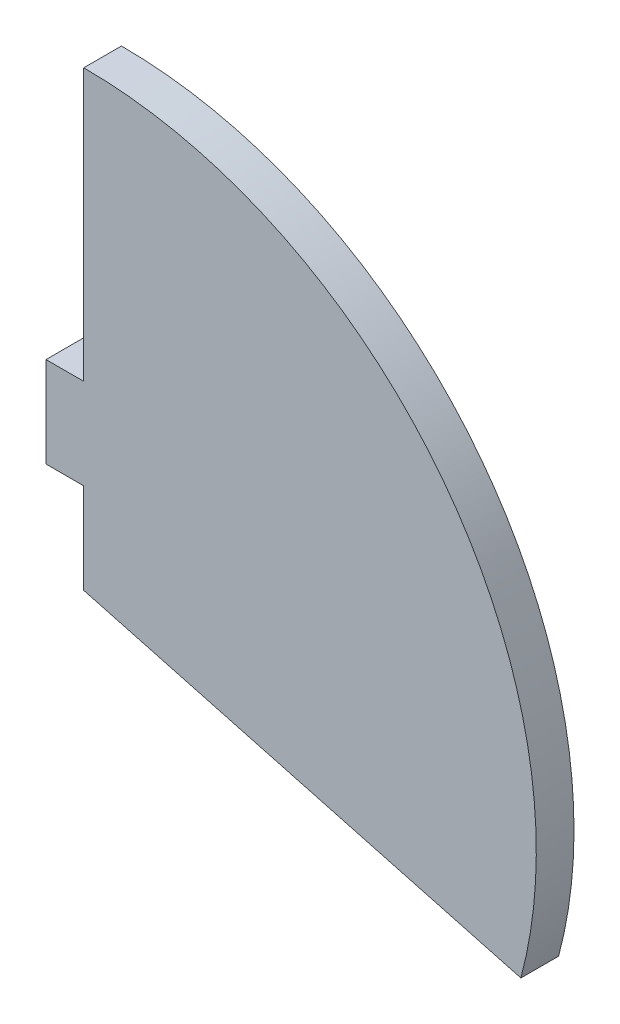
ISO-10303-21;
HEADER;
FILE_DESCRIPTION(('STEP AP214'),'2;1');
FILE_NAME('part.step','',(''),(''),'','','');
FILE_SCHEMA(('AUTOMOTIVE_DESIGN { 1 0 10303 214 1 1 1 1 }'));
ENDSEC;
DATA;
#1=APPLICATION_CONTEXT('core data for automotive mechanical design processes');
#2=APPLICATION_PROTOCOL_DEFINITION('international standard','automotive_design',2000,#1);
#3=PRODUCT_CONTEXT('',#1,'mechanical');
#4=PRODUCT('Part','Part','',(#3));
#5=PRODUCT_RELATED_PRODUCT_CATEGORY('part','',(#4));
#6=PRODUCT_DEFINITION_FORMATION('','',#4);
#7=PRODUCT_DEFINITION_CONTEXT('part definition',#1,'design');
#8=PRODUCT_DEFINITION('design','',#6,#7);
#9=PRODUCT_DEFINITION_SHAPE('','',#8);
#10=(LENGTH_UNIT() NAMED_UNIT(*) SI_UNIT(.MILLI.,.METRE.));
#11=(NAMED_UNIT(*) PLANE_ANGLE_UNIT() SI_UNIT($,.RADIAN.));
#12=(NAMED_UNIT(*) SI_UNIT($,.STERADIAN.) SOLID_ANGLE_UNIT());
#13=UNCERTAINTY_MEASURE_WITH_UNIT(LENGTH_MEASURE(1.E-05),#10,'distance_accuracy_value','');
#14=(GEOMETRIC_REPRESENTATION_CONTEXT(3) GLOBAL_UNCERTAINTY_ASSIGNED_CONTEXT((#13)) GLOBAL_UNIT_ASSIGNED_CONTEXT((#10,
#11,#12)) REPRESENTATION_CONTEXT('',''));
#15=CARTESIAN_POINT('',(0.,0.,0.));
#16=DIRECTION('',(0.,0.,1.));
#17=DIRECTION('',(1.,0.,0.));
#18=AXIS2_PLACEMENT_3D('',#15,#16,#17);
#19=CARTESIAN_POINT('',(-2.5,12.,2.5));
#20=DIRECTION('',(0.,1.,0.));
#21=DIRECTION('',(0.,0.,1.));
#22=AXIS2_PLACEMENT_3D('',#19,#20,#21);
#23=PLANE('',#22);
#24=DIRECTION('',(1.,0.,0.));
#25=VECTOR('',#24,1.);
#26=CARTESIAN_POINT('',(-2.5,12.,0.));
#27=LINE('',#26,#25);
#28=CARTESIAN_POINT('',(-2.5,12.,0.));
#29=VERTEX_POINT('',#28);
#30=CARTESIAN_POINT('',(0.,12.,0.));
#31=VERTEX_POINT('',#30);
#32=EDGE_CURVE('E123',#29,#31,#27,.T.);
#33=ORIENTED_EDGE('',*,*,#32,.F.);
#34=DIRECTION('',(0.,0.,-1.));
#35=VECTOR('',#34,1.);
#36=CARTESIAN_POINT('',(-2.5,12.,2.5));
#37=LINE('',#36,#35);
#38=CARTESIAN_POINT('',(-2.5,12.,2.5));
#39=VERTEX_POINT('',#38);
#40=EDGE_CURVE('E11',#39,#29,#37,.T.);
#41=ORIENTED_EDGE('',*,*,#40,.F.);
#42=DIRECTION('',(1.,0.,0.));
#43=VECTOR('',#42,1.);
#44=CARTESIAN_POINT('',(-2.5,12.,2.5));
#45=LINE('',#44,#43);
#46=CARTESIAN_POINT('',(0.,12.,2.5));
#47=VERTEX_POINT('',#46);
#48=EDGE_CURVE('E139',#39,#47,#45,.T.);
#49=ORIENTED_EDGE('',*,*,#48,.T.);
#50=DIRECTION('',(0.,0.,-1.));
#51=VECTOR('',#50,1.);
#52=CARTESIAN_POINT('',(0.,12.,2.5));
#53=LINE('',#52,#51);
#54=EDGE_CURVE('E36',#47,#31,#53,.T.);
#55=ORIENTED_EDGE('',*,*,#54,.T.);
#56=EDGE_LOOP('',(#33,#41,#49,#55));
#57=FACE_BOUND('',#56,.T.);
#58=ADVANCED_FACE('F33',(#57),#23,.T.);
#59=CARTESIAN_POINT('',(-2.5,6.,2.5));
#60=DIRECTION('',(-1.,0.,0.));
#61=DIRECTION('',(0.,0.,1.));
#62=AXIS2_PLACEMENT_3D('',#59,#60,#61);
#63=PLANE('',#62);
#64=DIRECTION('',(0.,1.,0.));
#65=VECTOR('',#64,1.);
#66=CARTESIAN_POINT('',(-2.5,6.,0.));
#67=LINE('',#66,#65);
#68=CARTESIAN_POINT('',(-2.5,6.,0.));
#69=VERTEX_POINT('',#68);
#70=EDGE_CURVE('E137',#69,#29,#67,.T.);
#71=ORIENTED_EDGE('',*,*,#70,.F.);
#72=DIRECTION('',(0.,0.,-1.));
#73=VECTOR('',#72,1.);
#74=CARTESIAN_POINT('',(-2.5,6.,2.5));
#75=LINE('',#74,#73);
#76=CARTESIAN_POINT('',(-2.5,6.,2.5));
#77=VERTEX_POINT('',#76);
#78=EDGE_CURVE('E42',#77,#69,#75,.T.);
#79=ORIENTED_EDGE('',*,*,#78,.F.);
#80=DIRECTION('',(0.,1.,0.));
#81=VECTOR('',#80,1.);
#82=CARTESIAN_POINT('',(-2.5,6.,2.5));
#83=LINE('',#82,#81);
#84=EDGE_CURVE('E112',#77,#39,#83,.T.);
#85=ORIENTED_EDGE('',*,*,#84,.T.);
#86=ORIENTED_EDGE('',*,*,#40,.T.);
#87=EDGE_LOOP('',(#71,#79,#85,#86));
#88=FACE_BOUND('',#87,.T.);
#89=ADVANCED_FACE('F151',(#88),#63,.T.);
#90=CARTESIAN_POINT('',(0.,6.,2.5));
#91=DIRECTION('',(0.,-1.,0.));
#92=DIRECTION('',(1.,0.,0.));
#93=AXIS2_PLACEMENT_3D('',#90,#91,#92);
#94=PLANE('',#93);
#95=DIRECTION('',(-1.,0.,0.));
#96=VECTOR('',#95,1.);
#97=CARTESIAN_POINT('',(0.,6.,0.));
#98=LINE('',#97,#96);
#99=CARTESIAN_POINT('',(0.,6.,0.));
#100=VERTEX_POINT('',#99);
#101=EDGE_CURVE('E101',#100,#69,#98,.T.);
#102=ORIENTED_EDGE('',*,*,#101,.F.);
#103=DIRECTION('',(0.,0.,-1.));
#104=VECTOR('',#103,1.);
#105=CARTESIAN_POINT('',(0.,6.,2.5));
#106=LINE('',#105,#104);
#107=CARTESIAN_POINT('',(0.,6.,2.5));
#108=VERTEX_POINT('',#107);
#109=EDGE_CURVE('E96',#108,#100,#106,.T.);
#110=ORIENTED_EDGE('',*,*,#109,.F.);
#111=DIRECTION('',(-1.,0.,0.));
#112=VECTOR('',#111,1.);
#113=CARTESIAN_POINT('',(0.,6.,2.5));
#114=LINE('',#113,#112);
#115=EDGE_CURVE('E99',#108,#77,#114,.T.);
#116=ORIENTED_EDGE('',*,*,#115,.T.);
#117=ORIENTED_EDGE('',*,*,#78,.T.);
#118=EDGE_LOOP('',(#102,#110,#116,#117));
#119=FACE_BOUND('',#118,.T.);
#120=ADVANCED_FACE('F98',(#119),#94,.T.);
#121=CARTESIAN_POINT('',(0.,0.,2.5));
#122=DIRECTION('',(-1.,0.,0.));
#123=DIRECTION('',(0.,0.,1.));
#124=AXIS2_PLACEMENT_3D('',#121,#122,#123);
#125=PLANE('',#124);
#126=DIRECTION('',(0.,1.,0.));
#127=VECTOR('',#126,1.);
#128=CARTESIAN_POINT('',(0.,0.,0.));
#129=LINE('',#128,#127);
#130=CARTESIAN_POINT('',(0.,0.,0.));
#131=VERTEX_POINT('',#130);
#132=EDGE_CURVE('E134',#131,#100,#129,.T.);
#133=ORIENTED_EDGE('',*,*,#132,.F.);
#134=DIRECTION('',(0.,0.,-1.));
#135=VECTOR('',#134,1.);
#136=CARTESIAN_POINT('',(0.,0.,2.5));
#137=LINE('',#136,#135);
#138=CARTESIAN_POINT('',(0.,0.,2.5));
#139=VERTEX_POINT('',#138);
#140=EDGE_CURVE('E106',#139,#131,#137,.T.);
#141=ORIENTED_EDGE('',*,*,#140,.F.);
#142=DIRECTION('',(0.,1.,0.));
#143=VECTOR('',#142,1.);
#144=CARTESIAN_POINT('',(0.,0.,2.5));
#145=LINE('',#144,#143);
#146=EDGE_CURVE('E111',#139,#108,#145,.T.);
#147=ORIENTED_EDGE('',*,*,#146,.T.);
#148=ORIENTED_EDGE('',*,*,#109,.T.);
#149=EDGE_LOOP('',(#133,#141,#147,#148));
#150=FACE_BOUND('',#149,.T.);
#151=ADVANCED_FACE('F114',(#150),#125,.T.);
#152=CARTESIAN_POINT('',(0.,0.,2.5));
#153=DIRECTION('',(0.258819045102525,0.965925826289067,0.));
#154=DIRECTION('',(-0.965925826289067,0.258819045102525,0.));
#155=AXIS2_PLACEMENT_3D('',#152,#153,#154);
#156=PLANE('',#155);
#157=DIRECTION('',(0.965925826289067,-0.258819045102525,0.));
#158=VECTOR('',#157,1.);
#159=CARTESIAN_POINT('',(0.,0.,0.));
#160=LINE('',#159,#158);
#161=CARTESIAN_POINT('',(28.977774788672,-7.76457135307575,0.));
#162=VERTEX_POINT('',#161);
#163=EDGE_CURVE('E132',#131,#162,#160,.T.);
#164=ORIENTED_EDGE('',*,*,#163,.T.);
#165=DIRECTION('',(0.,0.,-1.));
#166=VECTOR('',#165,1.);
#167=CARTESIAN_POINT('',(28.977774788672,-7.76457135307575,2.5));
#168=LINE('',#167,#166);
#169=CARTESIAN_POINT('',(28.977774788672,-7.76457135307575,2.5));
#170=VERTEX_POINT('',#169);
#171=EDGE_CURVE('E143',#170,#162,#168,.T.);
#172=ORIENTED_EDGE('',*,*,#171,.F.);
#173=DIRECTION('',(0.965925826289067,-0.258819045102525,0.));
#174=VECTOR('',#173,1.);
#175=CARTESIAN_POINT('',(0.,0.,2.5));
#176=LINE('',#175,#174);
#177=EDGE_CURVE('E116',#139,#170,#176,.T.);
#178=ORIENTED_EDGE('',*,*,#177,.F.);
#179=ORIENTED_EDGE('',*,*,#140,.T.);
#180=EDGE_LOOP('',(#164,#172,#178,#179));
#181=FACE_BOUND('',#180,.T.);
#182=ADVANCED_FACE('F164',(#181),#156,.F.);
#183=CARTESIAN_POINT('',(0.,0.,2.5));
#184=DIRECTION('',(0.,0.,-1.));
#185=DIRECTION('',(-1.,0.,0.));
#186=AXIS2_PLACEMENT_3D('',#183,#184,#185);
#187=CYLINDRICAL_SURFACE('',#186,30.);
#188=CARTESIAN_POINT('',(0.,0.,0.));
#189=DIRECTION('',(0.,0.,1.));
#190=DIRECTION('',(1.,0.,0.));
#191=AXIS2_PLACEMENT_3D('',#188,#189,#190);
#192=CIRCLE('',#191,30.);
#193=CARTESIAN_POINT('',(0.,30.,0.));
#194=VERTEX_POINT('',#193);
#195=EDGE_CURVE('E129',#162,#194,#192,.T.);
#196=ORIENTED_EDGE('',*,*,#195,.T.);
#197=DIRECTION('',(0.,0.,-1.));
#198=VECTOR('',#197,1.);
#199=CARTESIAN_POINT('',(0.,30.,2.5));
#200=LINE('',#199,#198);
#201=CARTESIAN_POINT('',(0.,30.,2.5));
#202=VERTEX_POINT('',#201);
#203=EDGE_CURVE('E145',#202,#194,#200,.T.);
#204=ORIENTED_EDGE('',*,*,#203,.F.);
#205=CARTESIAN_POINT('',(0.,0.,2.5));
#206=DIRECTION('',(0.,0.,1.));
#207=DIRECTION('',(1.,0.,0.));
#208=AXIS2_PLACEMENT_3D('',#205,#206,#207);
#209=CIRCLE('',#208,30.);
#210=EDGE_CURVE('E118',#170,#202,#209,.T.);
#211=ORIENTED_EDGE('',*,*,#210,.F.);
#212=ORIENTED_EDGE('',*,*,#171,.T.);
#213=EDGE_LOOP('',(#196,#204,#211,#212));
#214=FACE_BOUND('',#213,.T.);
#215=ADVANCED_FACE('F167',(#214),#187,.T.);
#216=CARTESIAN_POINT('',(0.,12.,2.5));
#217=DIRECTION('',(-1.,0.,0.));
#218=DIRECTION('',(0.,0.,1.));
#219=AXIS2_PLACEMENT_3D('',#216,#217,#218);
#220=PLANE('',#219);
#221=DIRECTION('',(0.,1.,0.));
#222=VECTOR('',#221,1.);
#223=CARTESIAN_POINT('',(0.,12.,0.));
#224=LINE('',#223,#222);
#225=EDGE_CURVE('E126',#31,#194,#224,.T.);
#226=ORIENTED_EDGE('',*,*,#225,.F.);
#227=ORIENTED_EDGE('',*,*,#54,.F.);
#228=DIRECTION('',(0.,1.,0.));
#229=VECTOR('',#228,1.);
#230=CARTESIAN_POINT('',(0.,12.,2.5));
#231=LINE('',#230,#229);
#232=EDGE_CURVE('E229',#47,#202,#231,.T.);
#233=ORIENTED_EDGE('',*,*,#232,.T.);
#234=ORIENTED_EDGE('',*,*,#203,.T.);
#235=EDGE_LOOP('',(#226,#227,#233,#234));
#236=FACE_BOUND('',#235,.T.);
#237=ADVANCED_FACE('F147',(#236),#220,.T.);
#238=CARTESIAN_POINT('',(0.,0.,2.5));
#239=DIRECTION('',(0.,0.,1.));
#240=DIRECTION('',(1.,0.,0.));
#241=AXIS2_PLACEMENT_3D('',#238,#239,#240);
#242=PLANE('',#241);
#243=ORIENTED_EDGE('',*,*,#48,.F.);
#244=ORIENTED_EDGE('',*,*,#84,.F.);
#245=ORIENTED_EDGE('',*,*,#115,.F.);
#246=ORIENTED_EDGE('',*,*,#146,.F.);
#247=ORIENTED_EDGE('',*,*,#177,.T.);
#248=ORIENTED_EDGE('',*,*,#210,.T.);
#249=ORIENTED_EDGE('',*,*,#232,.F.);
#250=EDGE_LOOP('',(#243,#244,#245,#246,#247,#248,#249));
#251=FACE_BOUND('',#250,.T.);
#252=ADVANCED_FACE('F110',(#251),#242,.T.);
#253=CARTESIAN_POINT('',(0.,0.,0.));
#254=DIRECTION('',(0.,0.,1.));
#255=DIRECTION('',(1.,0.,0.));
#256=AXIS2_PLACEMENT_3D('',#253,#254,#255);
#257=PLANE('',#256);
#258=ORIENTED_EDGE('',*,*,#32,.T.);
#259=ORIENTED_EDGE('',*,*,#225,.T.);
#260=ORIENTED_EDGE('',*,*,#195,.F.);
#261=ORIENTED_EDGE('',*,*,#163,.F.);
#262=ORIENTED_EDGE('',*,*,#132,.T.);
#263=ORIENTED_EDGE('',*,*,#101,.T.);
#264=ORIENTED_EDGE('',*,*,#70,.T.);
#265=EDGE_LOOP('',(#258,#259,#260,#261,#262,#263,#264));
#266=FACE_BOUND('',#265,.T.);
#267=ADVANCED_FACE('F150',(#266),#257,.F.);
#268=CLOSED_SHELL('',(#58,#89,#120,#151,#182,#215,#237,#252,#267));
#269=MANIFOLD_SOLID_BREP('B2',#268);
#270=ADVANCED_BREP_SHAPE_REPRESENTATION('',(#18,#269),#14);
#271=SHAPE_DEFINITION_REPRESENTATION(#9,#270);
ENDSEC;
END-ISO-10303-21;
